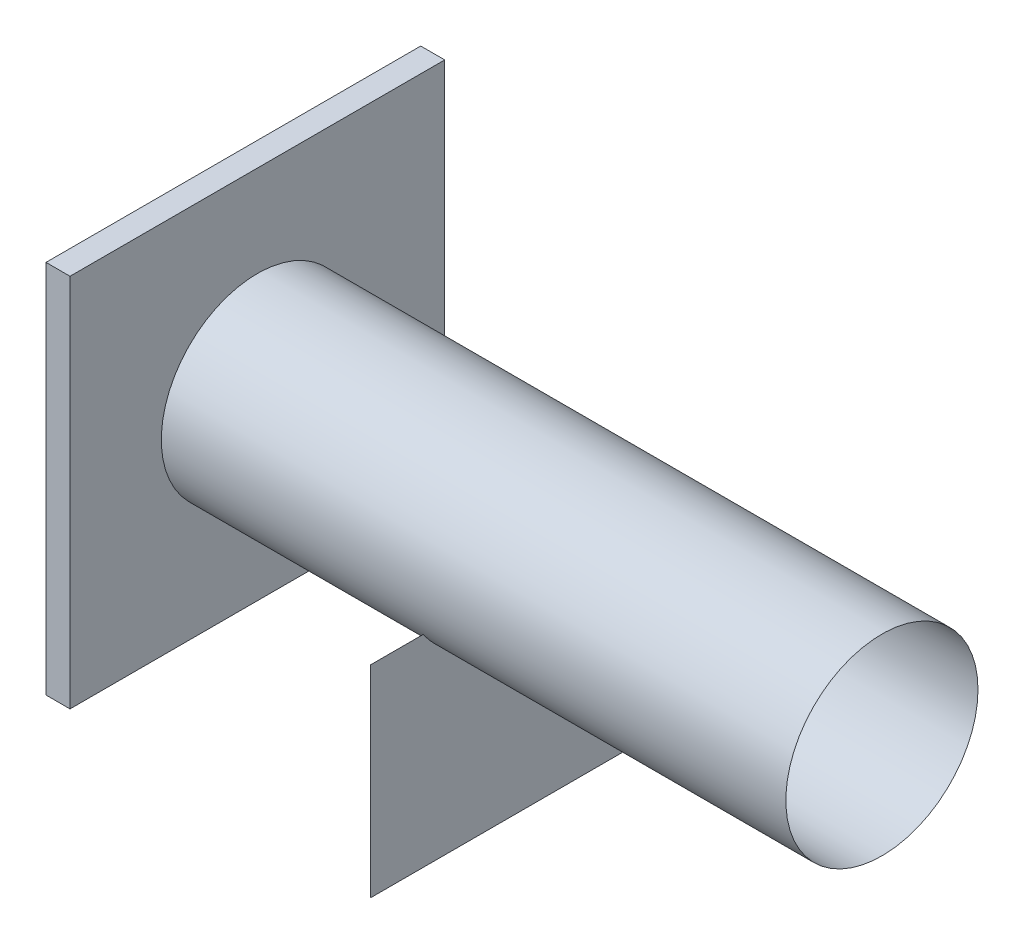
ISO-10303-21;
HEADER;
FILE_DESCRIPTION(('STEP AP214'),'2;1');
FILE_NAME('part.step','',(''),(''),'','','');
FILE_SCHEMA(('AUTOMOTIVE_DESIGN { 1 0 10303 214 1 1 1 1 }'));
ENDSEC;
DATA;
#1=APPLICATION_CONTEXT('core data for automotive mechanical design processes');
#2=APPLICATION_PROTOCOL_DEFINITION('international standard','automotive_design',2000,#1);
#3=PRODUCT_CONTEXT('',#1,'mechanical');
#4=PRODUCT('Part','Part','',(#3));
#5=PRODUCT_RELATED_PRODUCT_CATEGORY('part','',(#4));
#6=PRODUCT_DEFINITION_FORMATION('','',#4);
#7=PRODUCT_DEFINITION_CONTEXT('part definition',#1,'design');
#8=PRODUCT_DEFINITION('design','',#6,#7);
#9=PRODUCT_DEFINITION_SHAPE('','',#8);
#10=(LENGTH_UNIT() NAMED_UNIT(*) SI_UNIT(.MILLI.,.METRE.));
#11=(NAMED_UNIT(*) PLANE_ANGLE_UNIT() SI_UNIT($,.RADIAN.));
#12=(NAMED_UNIT(*) SI_UNIT($,.STERADIAN.) SOLID_ANGLE_UNIT());
#13=UNCERTAINTY_MEASURE_WITH_UNIT(LENGTH_MEASURE(1.E-05),#10,'distance_accuracy_value','');
#14=(GEOMETRIC_REPRESENTATION_CONTEXT(3) GLOBAL_UNCERTAINTY_ASSIGNED_CONTEXT((#13)) GLOBAL_UNIT_ASSIGNED_CONTEXT((#10,
#11,#12)) REPRESENTATION_CONTEXT('',''));
#15=CARTESIAN_POINT('',(0.,0.,0.));
#16=DIRECTION('',(0.,0.,1.));
#17=DIRECTION('',(1.,0.,0.));
#18=AXIS2_PLACEMENT_3D('',#15,#16,#17);
#19=CARTESIAN_POINT('',(-50.,-390.,390.));
#20=DIRECTION('',(0.,0.,1.));
#21=DIRECTION('',(1.,0.,0.));
#22=AXIS2_PLACEMENT_3D('',#19,#20,#21);
#23=PLANE('',#22);
#24=DIRECTION('',(0.,-1.,0.));
#25=VECTOR('',#24,1.);
#26=CARTESIAN_POINT('',(0.,-390.,390.));
#27=LINE('',#26,#25);
#28=CARTESIAN_POINT('',(0.,390.,390.));
#29=VERTEX_POINT('',#28);
#30=CARTESIAN_POINT('',(0.,-390.,390.));
#31=VERTEX_POINT('',#30);
#32=EDGE_CURVE('E115',#29,#31,#27,.T.);
#33=ORIENTED_EDGE('',*,*,#32,.F.);
#34=DIRECTION('',(1.,0.,0.));
#35=VECTOR('',#34,1.);
#36=CARTESIAN_POINT('',(-50.,390.,390.));
#37=LINE('',#36,#35);
#38=CARTESIAN_POINT('',(-50.,390.,390.));
#39=VERTEX_POINT('',#38);
#40=EDGE_CURVE('E12',#39,#29,#37,.T.);
#41=ORIENTED_EDGE('',*,*,#40,.F.);
#42=DIRECTION('',(0.,-1.,0.));
#43=VECTOR('',#42,1.);
#44=CARTESIAN_POINT('',(-50.,-390.,390.));
#45=LINE('',#44,#43);
#46=CARTESIAN_POINT('',(-50.,-390.,390.));
#47=VERTEX_POINT('',#46);
#48=EDGE_CURVE('E108',#39,#47,#45,.T.);
#49=ORIENTED_EDGE('',*,*,#48,.T.);
#50=DIRECTION('',(1.,0.,0.));
#51=VECTOR('',#50,1.);
#52=CARTESIAN_POINT('',(-50.,-390.,390.));
#53=LINE('',#52,#51);
#54=EDGE_CURVE('E53',#47,#31,#53,.T.);
#55=ORIENTED_EDGE('',*,*,#54,.T.);
#56=EDGE_LOOP('',(#33,#41,#49,#55));
#57=FACE_BOUND('',#56,.T.);
#58=ADVANCED_FACE('F50',(#57),#23,.T.);
#59=CARTESIAN_POINT('',(-50.,390.,-390.));
#60=DIRECTION('',(0.,1.,0.));
#61=DIRECTION('',(0.,0.,1.));
#62=AXIS2_PLACEMENT_3D('',#59,#60,#61);
#63=PLANE('',#62);
#64=DIRECTION('',(0.,0.,1.));
#65=VECTOR('',#64,1.);
#66=CARTESIAN_POINT('',(0.,390.,-390.));
#67=LINE('',#66,#65);
#68=CARTESIAN_POINT('',(0.,390.,-390.));
#69=VERTEX_POINT('',#68);
#70=EDGE_CURVE('E110',#69,#29,#67,.T.);
#71=ORIENTED_EDGE('',*,*,#70,.F.);
#72=DIRECTION('',(1.,0.,0.));
#73=VECTOR('',#72,1.);
#74=CARTESIAN_POINT('',(-50.,390.,-390.));
#75=LINE('',#74,#73);
#76=CARTESIAN_POINT('',(-50.,390.,-390.));
#77=VERTEX_POINT('',#76);
#78=EDGE_CURVE('E59',#77,#69,#75,.T.);
#79=ORIENTED_EDGE('',*,*,#78,.F.);
#80=DIRECTION('',(0.,0.,1.));
#81=VECTOR('',#80,1.);
#82=CARTESIAN_POINT('',(-50.,390.,-390.));
#83=LINE('',#82,#81);
#84=EDGE_CURVE('E105',#77,#39,#83,.T.);
#85=ORIENTED_EDGE('',*,*,#84,.T.);
#86=ORIENTED_EDGE('',*,*,#40,.T.);
#87=EDGE_LOOP('',(#71,#79,#85,#86));
#88=FACE_BOUND('',#87,.T.);
#89=ADVANCED_FACE('F126',(#88),#63,.T.);
#90=CARTESIAN_POINT('',(-50.,-390.,-390.));
#91=DIRECTION('',(0.,0.,-1.));
#92=DIRECTION('',(-1.,0.,0.));
#93=AXIS2_PLACEMENT_3D('',#90,#91,#92);
#94=PLANE('',#93);
#95=DIRECTION('',(0.,1.,0.));
#96=VECTOR('',#95,1.);
#97=CARTESIAN_POINT('',(0.,-390.,-390.));
#98=LINE('',#97,#96);
#99=CARTESIAN_POINT('',(0.,-390.,-390.));
#100=VERTEX_POINT('',#99);
#101=EDGE_CURVE('E100',#100,#69,#98,.T.);
#102=ORIENTED_EDGE('',*,*,#101,.F.);
#103=DIRECTION('',(1.,0.,0.));
#104=VECTOR('',#103,1.);
#105=CARTESIAN_POINT('',(-50.,-390.,-390.));
#106=LINE('',#105,#104);
#107=CARTESIAN_POINT('',(-50.,-390.,-390.));
#108=VERTEX_POINT('',#107);
#109=EDGE_CURVE('E95',#108,#100,#106,.T.);
#110=ORIENTED_EDGE('',*,*,#109,.F.);
#111=DIRECTION('',(0.,1.,0.));
#112=VECTOR('',#111,1.);
#113=CARTESIAN_POINT('',(-50.,-390.,-390.));
#114=LINE('',#113,#112);
#115=EDGE_CURVE('E98',#108,#77,#114,.T.);
#116=ORIENTED_EDGE('',*,*,#115,.T.);
#117=ORIENTED_EDGE('',*,*,#78,.T.);
#118=EDGE_LOOP('',(#102,#110,#116,#117));
#119=FACE_BOUND('',#118,.T.);
#120=ADVANCED_FACE('F97',(#119),#94,.T.);
#121=CARTESIAN_POINT('',(-50.,-390.,-390.));
#122=DIRECTION('',(0.,-1.,0.));
#123=DIRECTION('',(0.,0.,-1.));
#124=AXIS2_PLACEMENT_3D('',#121,#122,#123);
#125=PLANE('',#124);
#126=DIRECTION('',(0.,0.,-1.));
#127=VECTOR('',#126,1.);
#128=CARTESIAN_POINT('',(0.,-390.,-390.));
#129=LINE('',#128,#127);
#130=EDGE_CURVE('E118',#31,#100,#129,.T.);
#131=ORIENTED_EDGE('',*,*,#130,.F.);
#132=ORIENTED_EDGE('',*,*,#54,.F.);
#133=DIRECTION('',(0.,0.,-1.));
#134=VECTOR('',#133,1.);
#135=CARTESIAN_POINT('',(-50.,-390.,-390.));
#136=LINE('',#135,#134);
#137=EDGE_CURVE('E104',#47,#108,#136,.T.);
#138=ORIENTED_EDGE('',*,*,#137,.T.);
#139=ORIENTED_EDGE('',*,*,#109,.T.);
#140=EDGE_LOOP('',(#131,#132,#138,#139));
#141=FACE_BOUND('',#140,.T.);
#142=ADVANCED_FACE('F107',(#141),#125,.T.);
#143=CARTESIAN_POINT('',(-50.,390.,390.));
#144=DIRECTION('',(1.,0.,0.));
#145=DIRECTION('',(0.,0.,-1.));
#146=AXIS2_PLACEMENT_3D('',#143,#144,#145);
#147=PLANE('',#146);
#148=CARTESIAN_POINT('',(-50.,0.,0.));
#149=DIRECTION('',(1.,0.,0.));
#150=DIRECTION('',(0.,0.,-1.));
#151=AXIS2_PLACEMENT_3D('',#148,#149,#150);
#152=CIRCLE('',#151,190.);
#153=CARTESIAN_POINT('',(-50.,0.,-190.));
#154=VERTEX_POINT('',#153);
#155=EDGE_CURVE('E119',#154,#154,#152,.T.);
#156=ORIENTED_EDGE('',*,*,#155,.T.);
#157=EDGE_LOOP('',(#156));
#158=FACE_BOUND('',#157,.T.);
#159=ORIENTED_EDGE('',*,*,#48,.F.);
#160=ORIENTED_EDGE('',*,*,#84,.F.);
#161=ORIENTED_EDGE('',*,*,#115,.F.);
#162=ORIENTED_EDGE('',*,*,#137,.F.);
#163=EDGE_LOOP('',(#159,#160,#161,#162));
#164=FACE_BOUND('',#163,.T.);
#165=ADVANCED_FACE('F103',(#158,#164),#147,.F.);
#166=CARTESIAN_POINT('',(0.,390.,390.));
#167=DIRECTION('',(1.,0.,0.));
#168=DIRECTION('',(0.,0.,-1.));
#169=AXIS2_PLACEMENT_3D('',#166,#167,#168);
#170=PLANE('',#169);
#171=CARTESIAN_POINT('',(0.,0.,0.));
#172=DIRECTION('',(1.,0.,0.));
#173=DIRECTION('',(0.,0.,-1.));
#174=AXIS2_PLACEMENT_3D('',#171,#172,#173);
#175=CIRCLE('',#174,190.);
#176=CARTESIAN_POINT('',(0.,0.,-190.));
#177=VERTEX_POINT('',#176);
#178=EDGE_CURVE('E156',#177,#177,#175,.T.);
#179=ORIENTED_EDGE('',*,*,#178,.F.);
#180=EDGE_LOOP('',(#179));
#181=FACE_BOUND('',#180,.T.);
#182=ORIENTED_EDGE('',*,*,#32,.T.);
#183=ORIENTED_EDGE('',*,*,#130,.T.);
#184=ORIENTED_EDGE('',*,*,#101,.T.);
#185=ORIENTED_EDGE('',*,*,#70,.T.);
#186=EDGE_LOOP('',(#182,#183,#184,#185));
#187=FACE_BOUND('',#186,.T.);
#188=ADVANCED_FACE('F125',(#181,#187),#170,.T.);
#189=CARTESIAN_POINT('',(-50.,0.,0.));
#190=DIRECTION('',(1.,0.,0.));
#191=DIRECTION('',(0.,0.,-1.));
#192=AXIS2_PLACEMENT_3D('',#189,#190,#191);
#193=CYLINDRICAL_SURFACE('',#192,190.);
#194=ORIENTED_EDGE('',*,*,#155,.F.);
#195=EDGE_LOOP('',(#194));
#196=FACE_BOUND('',#195,.T.);
#197=ORIENTED_EDGE('',*,*,#178,.T.);
#198=EDGE_LOOP('',(#197));
#199=FACE_BOUND('',#198,.T.);
#200=ADVANCED_FACE('F144',(#196,#199),#193,.F.);
#201=CLOSED_SHELL('',(#58,#89,#120,#142,#165,#188,#200));
#202=MANIFOLD_SOLID_BREP('B2',#201);
#203=CARTESIAN_POINT('',(510.,0.,0.));
#204=DIRECTION('',(1.,0.,0.));
#205=DIRECTION('',(0.,0.,-1.));
#206=AXIS2_PLACEMENT_3D('',#203,#204,#205);
#207=PLANE('',#206);
#208=DIRECTION('',(0.,-1.,0.));
#209=VECTOR('',#208,1.);
#210=CARTESIAN_POINT('',(510.,-113.290598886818,275.));
#211=LINE('',#210,#209);
#212=CARTESIAN_POINT('',(510.,-113.290598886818,275.));
#213=VERTEX_POINT('',#212);
#214=CARTESIAN_POINT('',(510.,-533.290598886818,275.));
#215=VERTEX_POINT('',#214);
#216=EDGE_CURVE('E210',#213,#215,#211,.T.);
#217=ORIENTED_EDGE('',*,*,#216,.T.);
#218=DIRECTION('',(0.,0.,-1.));
#219=VECTOR('',#218,1.);
#220=CARTESIAN_POINT('',(510.,-533.290598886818,275.));
#221=LINE('',#220,#219);
#222=CARTESIAN_POINT('',(510.,-533.290598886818,-275.));
#223=VERTEX_POINT('',#222);
#224=EDGE_CURVE('E227',#215,#223,#221,.T.);
#225=ORIENTED_EDGE('',*,*,#224,.T.);
#226=DIRECTION('',(0.,1.,0.));
#227=VECTOR('',#226,1.);
#228=CARTESIAN_POINT('',(510.,-113.290598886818,-275.));
#229=LINE('',#228,#227);
#230=CARTESIAN_POINT('',(510.,-113.290598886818,-275.));
#231=VERTEX_POINT('',#230);
#232=EDGE_CURVE('E232',#223,#231,#229,.T.);
#233=ORIENTED_EDGE('',*,*,#232,.T.);
#234=DIRECTION('',(0.,0.,1.));
#235=VECTOR('',#234,1.);
#236=CARTESIAN_POINT('',(510.,-113.290598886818,-164.818810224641));
#237=LINE('',#236,#235);
#238=CARTESIAN_POINT('',(510.,-113.290598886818,-164.818810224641));
#239=VERTEX_POINT('',#238);
#240=EDGE_CURVE('E237',#231,#239,#237,.T.);
#241=ORIENTED_EDGE('',*,*,#240,.T.);
#242=CARTESIAN_POINT('',(510.,0.,0.));
#243=DIRECTION('',(-1.,0.,0.));
#244=DIRECTION('',(0.,0.,-1.));
#245=AXIS2_PLACEMENT_3D('',#242,#243,#244);
#246=CIRCLE('',#245,200.);
#247=CARTESIAN_POINT('',(510.,-113.290598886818,164.818810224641));
#248=VERTEX_POINT('',#247);
#249=EDGE_CURVE('E206',#239,#248,#246,.T.);
#250=ORIENTED_EDGE('',*,*,#249,.T.);
#251=DIRECTION('',(0.,0.,1.));
#252=VECTOR('',#251,1.);
#253=CARTESIAN_POINT('',(510.,-113.290598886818,275.));
#254=LINE('',#253,#252);
#255=EDGE_CURVE('E48',#248,#213,#254,.T.);
#256=ORIENTED_EDGE('',*,*,#255,.T.);
#257=EDGE_LOOP('',(#217,#225,#233,#241,#250,#256));
#258=FACE_BOUND('',#257,.T.);
#259=ADVANCED_FACE('F202',(#258),#207,.T.);
#260=OPEN_SHELL('',(#259));
#261=SHELL_BASED_SURFACE_MODEL('B6',(#260));
#262=CARTESIAN_POINT('',(0.,0.,0.));
#263=DIRECTION('',(1.,0.,0.));
#264=DIRECTION('',(0.,0.,-1.));
#265=AXIS2_PLACEMENT_3D('',#262,#263,#264);
#266=CYLINDRICAL_SURFACE('',#265,200.);
#267=CARTESIAN_POINT('',(0.,0.,0.));
#268=DIRECTION('',(1.,0.,0.));
#269=DIRECTION('',(0.,0.,-1.));
#270=AXIS2_PLACEMENT_3D('',#267,#268,#269);
#271=CIRCLE('',#270,200.);
#272=CARTESIAN_POINT('',(0.,0.,-200.));
#273=VERTEX_POINT('',#272);
#274=EDGE_CURVE('E280',#273,#273,#271,.T.);
#275=ORIENTED_EDGE('',*,*,#274,.T.);
#276=EDGE_LOOP('',(#275));
#277=FACE_BOUND('',#276,.T.);
#278=CARTESIAN_POINT('',(1300.,0.,0.));
#279=DIRECTION('',(1.,0.,0.));
#280=DIRECTION('',(0.,0.,-1.));
#281=AXIS2_PLACEMENT_3D('',#278,#279,#280);
#282=CIRCLE('',#281,200.);
#283=CARTESIAN_POINT('',(1300.,0.,-200.));
#284=VERTEX_POINT('',#283);
#285=EDGE_CURVE('E201',#284,#284,#282,.T.);
#286=ORIENTED_EDGE('',*,*,#285,.F.);
#287=EDGE_LOOP('',(#286));
#288=FACE_BOUND('',#287,.T.);
#289=ADVANCED_FACE('F276',(#277,#288),#266,.T.);
#290=OPEN_SHELL('',(#289));
#291=SHELL_BASED_SURFACE_MODEL('B42',(#290));
#292=ADVANCED_BREP_SHAPE_REPRESENTATION('',(#18,#202),#14);
#293=MANIFOLD_SURFACE_SHAPE_REPRESENTATION('',(#18,#261,#291),#14);
#294=SHAPE_REPRESENTATION('',(#18),#14);
#295=SHAPE_DEFINITION_REPRESENTATION(#9,#294);
#296=SHAPE_REPRESENTATION_RELATIONSHIP('','',#294,#292);
#297=SHAPE_REPRESENTATION_RELATIONSHIP('','',#294,#293);
ENDSEC;
END-ISO-10303-21;
